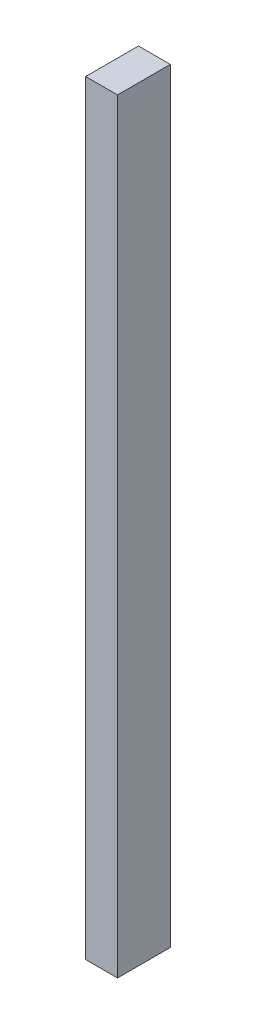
from build123d import *

# Parameters (mm, degrees)
SKETCH1_W           = 38
SKETCH1_H           = 912
BOSS_EXTRUDE1_DEPTH = 63


with BuildPart() as part:
    # Sketch1 → Boss-Extrude1 (new body)
    with BuildSketch(Plane.XY):
        with Locations((19, 456)):
            Rectangle(SKETCH1_W, SKETCH1_H)
    extrude(amount=BOSS_EXTRUDE1_DEPTH)


solid = part.part
